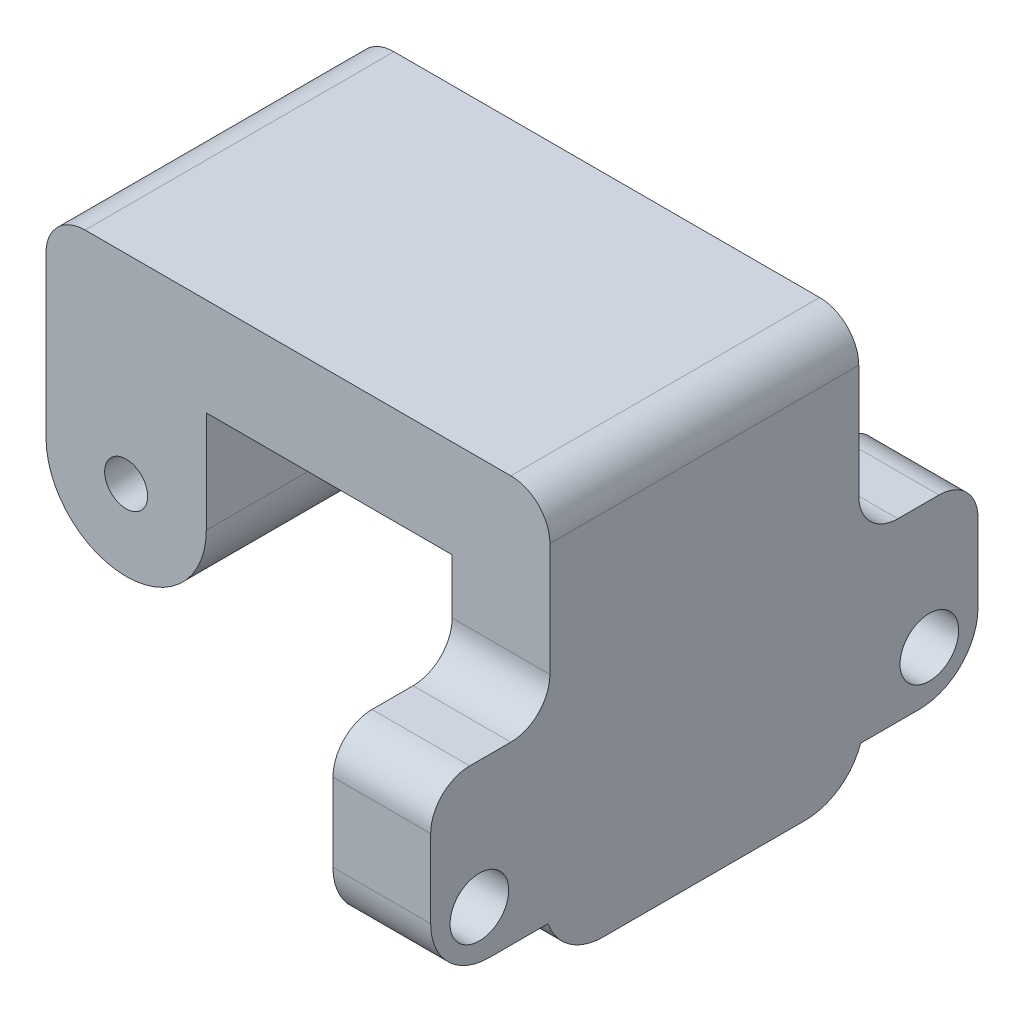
ISO-10303-21;
HEADER;
FILE_DESCRIPTION(('STEP AP214'),'2;1');
FILE_NAME('part.step','',(''),(''),'','','');
FILE_SCHEMA(('AUTOMOTIVE_DESIGN { 1 0 10303 214 1 1 1 1 }'));
ENDSEC;
DATA;
#1=APPLICATION_CONTEXT('core data for automotive mechanical design processes');
#2=APPLICATION_PROTOCOL_DEFINITION('international standard','automotive_design',2000,#1);
#3=PRODUCT_CONTEXT('',#1,'mechanical');
#4=PRODUCT('Part','Part','',(#3));
#5=PRODUCT_RELATED_PRODUCT_CATEGORY('part','',(#4));
#6=PRODUCT_DEFINITION_FORMATION('','',#4);
#7=PRODUCT_DEFINITION_CONTEXT('part definition',#1,'design');
#8=PRODUCT_DEFINITION('design','',#6,#7);
#9=PRODUCT_DEFINITION_SHAPE('','',#8);
#10=(LENGTH_UNIT() NAMED_UNIT(*) SI_UNIT(.MILLI.,.METRE.));
#11=(NAMED_UNIT(*) PLANE_ANGLE_UNIT() SI_UNIT($,.RADIAN.));
#12=(NAMED_UNIT(*) SI_UNIT($,.STERADIAN.) SOLID_ANGLE_UNIT());
#13=UNCERTAINTY_MEASURE_WITH_UNIT(LENGTH_MEASURE(1.E-05),#10,'distance_accuracy_value','');
#14=(GEOMETRIC_REPRESENTATION_CONTEXT(3) GLOBAL_UNCERTAINTY_ASSIGNED_CONTEXT((#13)) GLOBAL_UNIT_ASSIGNED_CONTEXT((#10,
#11,#12)) REPRESENTATION_CONTEXT('',''));
#15=CARTESIAN_POINT('',(0.,0.,0.));
#16=DIRECTION('',(0.,0.,1.));
#17=DIRECTION('',(1.,0.,0.));
#18=AXIS2_PLACEMENT_3D('',#15,#16,#17);
#19=CARTESIAN_POINT('',(21.6802232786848,0.,-7.9));
#20=DIRECTION('',(-1.,0.,0.));
#21=DIRECTION('',(0.,0.,1.));
#22=AXIS2_PLACEMENT_3D('',#19,#20,#21);
#23=PLANE('',#22);
#24=CARTESIAN_POINT('',(21.6802232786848,-6.1,-11.51));
#25=DIRECTION('',(1.,0.,0.));
#26=DIRECTION('',(0.,0.,1.));
#27=AXIS2_PLACEMENT_3D('',#24,#25,#26);
#28=CIRCLE('',#27,1.5);
#29=CARTESIAN_POINT('',(21.6802232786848,-6.1,-10.01));
#30=VERTEX_POINT('',#29);
#31=EDGE_CURVE('E224',#30,#30,#28,.T.);
#32=ORIENTED_EDGE('',*,*,#31,.F.);
#33=EDGE_LOOP('',(#32));
#34=FACE_BOUND('',#33,.T.);
#35=CARTESIAN_POINT('',(21.6802232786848,-6.1,11.51));
#36=DIRECTION('',(1.,0.,0.));
#37=DIRECTION('',(0.,0.,-1.));
#38=AXIS2_PLACEMENT_3D('',#35,#36,#37);
#39=CIRCLE('',#38,1.5);
#40=CARTESIAN_POINT('',(21.6802232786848,-6.1,10.01));
#41=VERTEX_POINT('',#40);
#42=EDGE_CURVE('E235',#41,#41,#39,.T.);
#43=ORIENTED_EDGE('',*,*,#42,.F.);
#44=EDGE_LOOP('',(#43));
#45=FACE_BOUND('',#44,.T.);
#46=DIRECTION('',(0.,0.,1.));
#47=VECTOR('',#46,1.);
#48=CARTESIAN_POINT('',(21.6802232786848,-8.59610842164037,0.));
#49=LINE('',#48,#47);
#50=CARTESIAN_POINT('',(21.6802232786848,-8.59610842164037,-11.));
#51=VERTEX_POINT('',#50);
#52=CARTESIAN_POINT('',(21.6802232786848,-8.59610842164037,-8.));
#53=VERTEX_POINT('',#52);
#54=EDGE_CURVE('E227',#51,#53,#49,.T.);
#55=ORIENTED_EDGE('',*,*,#54,.F.);
#56=CARTESIAN_POINT('',(21.6802232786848,-5.59610842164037,-11.));
#57=DIRECTION('',(-1.,0.,0.));
#58=DIRECTION('',(0.,0.,1.));
#59=AXIS2_PLACEMENT_3D('',#56,#57,#58);
#60=CIRCLE('',#59,3.);
#61=CARTESIAN_POINT('',(21.6802232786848,-5.59610842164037,-14.));
#62=VERTEX_POINT('',#61);
#63=EDGE_CURVE('E393',#51,#62,#60,.F.);
#64=ORIENTED_EDGE('',*,*,#63,.T.);
#65=DIRECTION('',(0.,-1.,0.));
#66=VECTOR('',#65,1.);
#67=CARTESIAN_POINT('',(21.6802232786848,0.,-14.));
#68=LINE('',#67,#66);
#69=CARTESIAN_POINT('',(21.6802232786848,-1.6,-14.));
#70=VERTEX_POINT('',#69);
#71=EDGE_CURVE('E248',#70,#62,#68,.T.);
#72=ORIENTED_EDGE('',*,*,#71,.F.);
#73=CARTESIAN_POINT('',(21.6802232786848,-1.6,-12.));
#74=DIRECTION('',(-1.,0.,0.));
#75=DIRECTION('',(0.,0.,1.));
#76=AXIS2_PLACEMENT_3D('',#73,#74,#75);
#77=CIRCLE('',#76,2.);
#78=CARTESIAN_POINT('',(21.6802232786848,0.4,-12.));
#79=VERTEX_POINT('',#78);
#80=EDGE_CURVE('E341',#70,#79,#77,.F.);
#81=ORIENTED_EDGE('',*,*,#80,.T.);
#82=DIRECTION('',(0.,0.,1.));
#83=VECTOR('',#82,1.);
#84=CARTESIAN_POINT('',(21.6802232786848,0.4,-14.));
#85=LINE('',#84,#83);
#86=CARTESIAN_POINT('',(21.6802232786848,0.4,-9.9));
#87=VERTEX_POINT('',#86);
#88=EDGE_CURVE('E255',#79,#87,#85,.T.);
#89=ORIENTED_EDGE('',*,*,#88,.T.);
#90=CARTESIAN_POINT('',(21.6802232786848,2.4,-9.9));
#91=DIRECTION('',(-1.,0.,0.));
#92=DIRECTION('',(0.,0.,1.));
#93=AXIS2_PLACEMENT_3D('',#90,#91,#92);
#94=CIRCLE('',#93,2.);
#95=CARTESIAN_POINT('',(21.6802232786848,2.4,-7.9));
#96=VERTEX_POINT('',#95);
#97=EDGE_CURVE('E370',#87,#96,#94,.T.);
#98=ORIENTED_EDGE('',*,*,#97,.T.);
#99=DIRECTION('',(0.,-1.,0.));
#100=VECTOR('',#99,1.);
#101=CARTESIAN_POINT('',(21.6802232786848,0.,-7.9));
#102=LINE('',#101,#100);
#103=CARTESIAN_POINT('',(21.6802232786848,8.2,-7.9));
#104=VERTEX_POINT('',#103);
#105=EDGE_CURVE('E295',#104,#96,#102,.T.);
#106=ORIENTED_EDGE('',*,*,#105,.F.);
#107=DIRECTION('',(0.,0.,1.));
#108=VECTOR('',#107,1.);
#109=CARTESIAN_POINT('',(21.6802232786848,8.2,-7.9));
#110=LINE('',#109,#108);
#111=CARTESIAN_POINT('',(21.6802232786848,8.2,7.9));
#112=VERTEX_POINT('',#111);
#113=EDGE_CURVE('E336',#104,#112,#110,.T.);
#114=ORIENTED_EDGE('',*,*,#113,.T.);
#115=DIRECTION('',(0.,-1.,0.));
#116=VECTOR('',#115,1.);
#117=CARTESIAN_POINT('',(21.6802232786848,0.,7.9));
#118=LINE('',#117,#116);
#119=CARTESIAN_POINT('',(21.6802232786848,2.4,7.9));
#120=VERTEX_POINT('',#119);
#121=EDGE_CURVE('E273',#112,#120,#118,.T.);
#122=ORIENTED_EDGE('',*,*,#121,.T.);
#123=CARTESIAN_POINT('',(21.6802232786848,2.4,9.9));
#124=DIRECTION('',(-1.,0.,0.));
#125=DIRECTION('',(0.,0.,1.));
#126=AXIS2_PLACEMENT_3D('',#123,#124,#125);
#127=CIRCLE('',#126,2.);
#128=CARTESIAN_POINT('',(21.6802232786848,0.4,9.9));
#129=VERTEX_POINT('',#128);
#130=EDGE_CURVE('E374',#120,#129,#127,.T.);
#131=ORIENTED_EDGE('',*,*,#130,.T.);
#132=CARTESIAN_POINT('',(21.6802232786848,0.4,12.));
#133=VERTEX_POINT('',#132);
#134=EDGE_CURVE('E252',#129,#133,#85,.T.);
#135=ORIENTED_EDGE('',*,*,#134,.T.);
#136=CARTESIAN_POINT('',(21.6802232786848,-1.6,12.));
#137=DIRECTION('',(-1.,0.,0.));
#138=DIRECTION('',(0.,0.,1.));
#139=AXIS2_PLACEMENT_3D('',#136,#137,#138);
#140=CIRCLE('',#139,2.);
#141=CARTESIAN_POINT('',(21.6802232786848,-1.6,14.));
#142=VERTEX_POINT('',#141);
#143=EDGE_CURVE('E339',#133,#142,#140,.F.);
#144=ORIENTED_EDGE('',*,*,#143,.T.);
#145=DIRECTION('',(0.,-1.,0.));
#146=VECTOR('',#145,1.);
#147=CARTESIAN_POINT('',(21.6802232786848,0.,14.));
#148=LINE('',#147,#146);
#149=CARTESIAN_POINT('',(21.6802232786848,-5.59610842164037,14.));
#150=VERTEX_POINT('',#149);
#151=EDGE_CURVE('E243',#142,#150,#148,.T.);
#152=ORIENTED_EDGE('',*,*,#151,.T.);
#153=CARTESIAN_POINT('',(21.6802232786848,-5.59610842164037,11.));
#154=DIRECTION('',(-1.,0.,0.));
#155=DIRECTION('',(0.,0.,1.));
#156=AXIS2_PLACEMENT_3D('',#153,#154,#155);
#157=CIRCLE('',#156,3.);
#158=CARTESIAN_POINT('',(21.6802232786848,-8.59610842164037,11.));
#159=VERTEX_POINT('',#158);
#160=EDGE_CURVE('E58',#150,#159,#157,.F.);
#161=ORIENTED_EDGE('',*,*,#160,.T.);
#162=DIRECTION('',(0.,0.,-1.));
#163=VECTOR('',#162,1.);
#164=CARTESIAN_POINT('',(21.6802232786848,-8.59610842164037,0.));
#165=LINE('',#164,#163);
#166=CARTESIAN_POINT('',(21.6802232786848,-8.59610842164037,8.));
#167=VERTEX_POINT('',#166);
#168=EDGE_CURVE('E213',#159,#167,#165,.T.);
#169=ORIENTED_EDGE('',*,*,#168,.T.);
#170=CARTESIAN_POINT('',(21.6802232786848,-7.59610842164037,5.17157287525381));
#171=DIRECTION('',(-1.,0.,0.));
#172=DIRECTION('',(0.,0.,1.));
#173=AXIS2_PLACEMENT_3D('',#170,#171,#172);
#174=CIRCLE('',#173,3.);
#175=CARTESIAN_POINT('',(21.6802232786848,-10.5961084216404,5.17157287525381));
#176=VERTEX_POINT('',#175);
#177=EDGE_CURVE('E66',#167,#176,#174,.F.);
#178=ORIENTED_EDGE('',*,*,#177,.T.);
#179=DIRECTION('',(0.,0.,1.));
#180=VECTOR('',#179,1.);
#181=CARTESIAN_POINT('',(21.6802232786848,-10.5961084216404,-7.9));
#182=LINE('',#181,#180);
#183=CARTESIAN_POINT('',(21.6802232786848,-10.5961084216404,-5.17157287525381));
#184=VERTEX_POINT('',#183);
#185=EDGE_CURVE('E308',#184,#176,#182,.T.);
#186=ORIENTED_EDGE('',*,*,#185,.F.);
#187=CARTESIAN_POINT('',(21.6802232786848,-7.59610842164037,-5.17157287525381));
#188=DIRECTION('',(-1.,0.,0.));
#189=DIRECTION('',(0.,0.,1.));
#190=AXIS2_PLACEMENT_3D('',#187,#188,#189);
#191=CIRCLE('',#190,3.);
#192=EDGE_CURVE('E210',#184,#53,#191,.F.);
#193=ORIENTED_EDGE('',*,*,#192,.T.);
#194=EDGE_LOOP('',(#55,#64,#72,#81,#89,#98,#106,#114,#122,#131,#135,#144,#152,#161,#169,#178,
#186,#193));
#195=FACE_BOUND('',#194,.T.);
#196=ADVANCED_FACE('F43',(#34,#45,#195),#23,.F.);
#197=CARTESIAN_POINT('',(0.,-10.5961084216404,-7.9));
#198=DIRECTION('',(0.,1.,0.));
#199=DIRECTION('',(-1.,0.,0.));
#200=AXIS2_PLACEMENT_3D('',#197,#198,#199);
#201=PLANE('',#200);
#202=DIRECTION('',(0.,0.,1.));
#203=VECTOR('',#202,1.);
#204=CARTESIAN_POINT('',(16.6802232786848,-10.5961084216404,-7.9));
#205=LINE('',#204,#203);
#206=CARTESIAN_POINT('',(16.6802232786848,-10.5961084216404,-5.17157287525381));
#207=VERTEX_POINT('',#206);
#208=CARTESIAN_POINT('',(16.6802232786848,-10.5961084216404,5.17157287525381));
#209=VERTEX_POINT('',#208);
#210=EDGE_CURVE('E310',#207,#209,#205,.T.);
#211=ORIENTED_EDGE('',*,*,#210,.F.);
#212=DIRECTION('',(-1.,0.,0.));
#213=VECTOR('',#212,1.);
#214=CARTESIAN_POINT('',(0.,-10.5961084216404,-5.17157287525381));
#215=LINE('',#214,#213);
#216=EDGE_CURVE('E396',#207,#184,#215,.F.);
#217=ORIENTED_EDGE('',*,*,#216,.T.);
#218=ORIENTED_EDGE('',*,*,#185,.T.);
#219=DIRECTION('',(1.,0.,0.));
#220=VECTOR('',#219,1.);
#221=CARTESIAN_POINT('',(0.,-10.5961084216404,5.17157287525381));
#222=LINE('',#221,#220);
#223=EDGE_CURVE('E209',#176,#209,#222,.F.);
#224=ORIENTED_EDGE('',*,*,#223,.T.);
#225=EDGE_LOOP('',(#211,#217,#218,#224));
#226=FACE_BOUND('',#225,.T.);
#227=ADVANCED_FACE('F492',(#226),#201,.F.);
#228=CARTESIAN_POINT('',(16.6802232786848,0.,-7.9));
#229=DIRECTION('',(1.,0.,0.));
#230=DIRECTION('',(0.,0.,-1.));
#231=AXIS2_PLACEMENT_3D('',#228,#229,#230);
#232=PLANE('',#231);
#233=CARTESIAN_POINT('',(16.6802232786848,-6.1,-11.51));
#234=DIRECTION('',(1.,0.,0.));
#235=DIRECTION('',(0.,0.,-1.));
#236=AXIS2_PLACEMENT_3D('',#233,#234,#235);
#237=CIRCLE('',#236,1.5);
#238=CARTESIAN_POINT('',(16.6802232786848,-6.1,-13.01));
#239=VERTEX_POINT('',#238);
#240=EDGE_CURVE('E238',#239,#239,#237,.T.);
#241=ORIENTED_EDGE('',*,*,#240,.T.);
#242=EDGE_LOOP('',(#241));
#243=FACE_BOUND('',#242,.T.);
#244=CARTESIAN_POINT('',(16.6802232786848,-6.1,11.51));
#245=DIRECTION('',(1.,0.,0.));
#246=DIRECTION('',(0.,0.,-1.));
#247=AXIS2_PLACEMENT_3D('',#244,#245,#246);
#248=CIRCLE('',#247,1.5);
#249=CARTESIAN_POINT('',(16.6802232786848,-6.1,10.01));
#250=VERTEX_POINT('',#249);
#251=EDGE_CURVE('E244',#250,#250,#248,.T.);
#252=ORIENTED_EDGE('',*,*,#251,.T.);
#253=EDGE_LOOP('',(#252));
#254=FACE_BOUND('',#253,.T.);
#255=DIRECTION('',(0.,1.,0.));
#256=VECTOR('',#255,1.);
#257=CARTESIAN_POINT('',(16.6802232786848,0.,-14.));
#258=LINE('',#257,#256);
#259=CARTESIAN_POINT('',(16.6802232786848,-5.59610842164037,-14.));
#260=VERTEX_POINT('',#259);
#261=CARTESIAN_POINT('',(16.6802232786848,-1.6,-14.));
#262=VERTEX_POINT('',#261);
#263=EDGE_CURVE('E246',#260,#262,#258,.T.);
#264=ORIENTED_EDGE('',*,*,#263,.F.);
#265=CARTESIAN_POINT('',(16.6802232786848,-5.59610842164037,-11.));
#266=DIRECTION('',(1.,0.,0.));
#267=DIRECTION('',(0.,0.,-1.));
#268=AXIS2_PLACEMENT_3D('',#265,#266,#267);
#269=CIRCLE('',#268,3.);
#270=CARTESIAN_POINT('',(16.6802232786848,-8.59610842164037,-11.));
#271=VERTEX_POINT('',#270);
#272=EDGE_CURVE('E387',#260,#271,#269,.F.);
#273=ORIENTED_EDGE('',*,*,#272,.T.);
#274=DIRECTION('',(0.,0.,-1.));
#275=VECTOR('',#274,1.);
#276=CARTESIAN_POINT('',(16.6802232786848,-8.59610842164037,0.));
#277=LINE('',#276,#275);
#278=CARTESIAN_POINT('',(16.6802232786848,-8.59610842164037,-8.));
#279=VERTEX_POINT('',#278);
#280=EDGE_CURVE('E217',#279,#271,#277,.T.);
#281=ORIENTED_EDGE('',*,*,#280,.F.);
#282=CARTESIAN_POINT('',(16.6802232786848,-7.59610842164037,-5.17157287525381));
#283=DIRECTION('',(1.,0.,0.));
#284=DIRECTION('',(0.,0.,-1.));
#285=AXIS2_PLACEMENT_3D('',#282,#283,#284);
#286=CIRCLE('',#285,3.);
#287=EDGE_CURVE('E385',#279,#207,#286,.F.);
#288=ORIENTED_EDGE('',*,*,#287,.T.);
#289=ORIENTED_EDGE('',*,*,#210,.T.);
#290=CARTESIAN_POINT('',(16.6802232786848,-7.59610842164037,5.17157287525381));
#291=DIRECTION('',(1.,0.,0.));
#292=DIRECTION('',(0.,0.,-1.));
#293=AXIS2_PLACEMENT_3D('',#290,#291,#292);
#294=CIRCLE('',#293,3.);
#295=CARTESIAN_POINT('',(16.6802232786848,-8.59610842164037,8.));
#296=VERTEX_POINT('',#295);
#297=EDGE_CURVE('E383',#209,#296,#294,.F.);
#298=ORIENTED_EDGE('',*,*,#297,.T.);
#299=DIRECTION('',(0.,0.,1.));
#300=VECTOR('',#299,1.);
#301=CARTESIAN_POINT('',(16.6802232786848,-8.59610842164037,0.));
#302=LINE('',#301,#300);
#303=CARTESIAN_POINT('',(16.6802232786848,-8.59610842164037,11.));
#304=VERTEX_POINT('',#303);
#305=EDGE_CURVE('E222',#296,#304,#302,.T.);
#306=ORIENTED_EDGE('',*,*,#305,.T.);
#307=CARTESIAN_POINT('',(16.6802232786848,-5.59610842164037,11.));
#308=DIRECTION('',(1.,0.,0.));
#309=DIRECTION('',(0.,0.,-1.));
#310=AXIS2_PLACEMENT_3D('',#307,#308,#309);
#311=CIRCLE('',#310,3.);
#312=CARTESIAN_POINT('',(16.6802232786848,-5.59610842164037,14.));
#313=VERTEX_POINT('',#312);
#314=EDGE_CURVE('E381',#304,#313,#311,.F.);
#315=ORIENTED_EDGE('',*,*,#314,.T.);
#316=DIRECTION('',(0.,1.,0.));
#317=VECTOR('',#316,1.);
#318=CARTESIAN_POINT('',(16.6802232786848,0.,14.));
#319=LINE('',#318,#317);
#320=CARTESIAN_POINT('',(16.6802232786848,-1.6,14.));
#321=VERTEX_POINT('',#320);
#322=EDGE_CURVE('E241',#313,#321,#319,.T.);
#323=ORIENTED_EDGE('',*,*,#322,.T.);
#324=CARTESIAN_POINT('',(16.6802232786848,-1.6,12.));
#325=DIRECTION('',(1.,0.,0.));
#326=DIRECTION('',(0.,0.,-1.));
#327=AXIS2_PLACEMENT_3D('',#324,#325,#326);
#328=CIRCLE('',#327,2.);
#329=CARTESIAN_POINT('',(16.6802232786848,0.4,12.));
#330=VERTEX_POINT('',#329);
#331=EDGE_CURVE('E343',#321,#330,#328,.F.);
#332=ORIENTED_EDGE('',*,*,#331,.T.);
#333=DIRECTION('',(0.,0.,1.));
#334=VECTOR('',#333,1.);
#335=CARTESIAN_POINT('',(16.6802232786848,0.4,-14.));
#336=LINE('',#335,#334);
#337=CARTESIAN_POINT('',(16.6802232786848,0.4,9.9));
#338=VERTEX_POINT('',#337);
#339=EDGE_CURVE('E251',#338,#330,#336,.T.);
#340=ORIENTED_EDGE('',*,*,#339,.F.);
#341=CARTESIAN_POINT('',(16.6802232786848,2.4,9.9));
#342=DIRECTION('',(1.,0.,0.));
#343=DIRECTION('',(0.,0.,-1.));
#344=AXIS2_PLACEMENT_3D('',#341,#342,#343);
#345=CIRCLE('',#344,2.);
#346=CARTESIAN_POINT('',(16.6802232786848,2.4,7.9));
#347=VERTEX_POINT('',#346);
#348=EDGE_CURVE('E376',#338,#347,#345,.T.);
#349=ORIENTED_EDGE('',*,*,#348,.T.);
#350=DIRECTION('',(0.,1.,0.));
#351=VECTOR('',#350,1.);
#352=CARTESIAN_POINT('',(16.6802232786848,0.,7.9));
#353=LINE('',#352,#351);
#354=CARTESIAN_POINT('',(16.6802232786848,5.2,7.9));
#355=VERTEX_POINT('',#354);
#356=EDGE_CURVE('E271',#347,#355,#353,.T.);
#357=ORIENTED_EDGE('',*,*,#356,.T.);
#358=DIRECTION('',(0.,0.,1.));
#359=VECTOR('',#358,1.);
#360=CARTESIAN_POINT('',(16.6802232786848,5.2,-7.9));
#361=LINE('',#360,#359);
#362=CARTESIAN_POINT('',(16.6802232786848,5.2,-7.9));
#363=VERTEX_POINT('',#362);
#364=EDGE_CURVE('E313',#363,#355,#361,.T.);
#365=ORIENTED_EDGE('',*,*,#364,.F.);
#366=DIRECTION('',(0.,1.,0.));
#367=VECTOR('',#366,1.);
#368=CARTESIAN_POINT('',(16.6802232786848,0.,-7.9));
#369=LINE('',#368,#367);
#370=CARTESIAN_POINT('',(16.6802232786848,2.4,-7.9));
#371=VERTEX_POINT('',#370);
#372=EDGE_CURVE('E293',#371,#363,#369,.T.);
#373=ORIENTED_EDGE('',*,*,#372,.F.);
#374=CARTESIAN_POINT('',(16.6802232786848,2.4,-9.9));
#375=DIRECTION('',(1.,0.,0.));
#376=DIRECTION('',(0.,0.,-1.));
#377=AXIS2_PLACEMENT_3D('',#374,#375,#376);
#378=CIRCLE('',#377,2.);
#379=CARTESIAN_POINT('',(16.6802232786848,0.4,-9.9));
#380=VERTEX_POINT('',#379);
#381=EDGE_CURVE('E372',#371,#380,#378,.T.);
#382=ORIENTED_EDGE('',*,*,#381,.T.);
#383=CARTESIAN_POINT('',(16.6802232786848,0.4,-12.));
#384=VERTEX_POINT('',#383);
#385=EDGE_CURVE('E256',#384,#380,#336,.T.);
#386=ORIENTED_EDGE('',*,*,#385,.F.);
#387=CARTESIAN_POINT('',(16.6802232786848,-1.6,-12.));
#388=DIRECTION('',(1.,0.,0.));
#389=DIRECTION('',(0.,0.,-1.));
#390=AXIS2_PLACEMENT_3D('',#387,#388,#389);
#391=CIRCLE('',#390,2.);
#392=EDGE_CURVE('E345',#384,#262,#391,.F.);
#393=ORIENTED_EDGE('',*,*,#392,.T.);
#394=EDGE_LOOP('',(#264,#273,#281,#288,#289,#298,#306,#315,#323,#332,#340,#349,#357,#365,#373,
#382,#386,#393));
#395=FACE_BOUND('',#394,.T.);
#396=ADVANCED_FACE('F416',(#243,#254,#395),#232,.F.);
#397=CARTESIAN_POINT('',(0.,0.,-7.9));
#398=DIRECTION('',(0.,0.,1.));
#399=DIRECTION('',(1.,0.,0.));
#400=AXIS2_PLACEMENT_3D('',#397,#398,#399);
#401=PLANE('',#400);
#402=CARTESIAN_POINT('',(0.,0.,-7.9));
#403=DIRECTION('',(0.,0.,1.));
#404=DIRECTION('',(1.,0.,0.));
#405=AXIS2_PLACEMENT_3D('',#402,#403,#404);
#406=CIRCLE('',#405,1.10000000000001);
#407=CARTESIAN_POINT('',(1.10000000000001,0.,-7.9));
#408=VERTEX_POINT('',#407);
#409=EDGE_CURVE('E282',#408,#408,#406,.T.);
#410=ORIENTED_EDGE('',*,*,#409,.T.);
#411=EDGE_LOOP('',(#410));
#412=FACE_BOUND('',#411,.T.);
#413=ORIENTED_EDGE('',*,*,#105,.T.);
#414=DIRECTION('',(1.,0.,0.));
#415=VECTOR('',#414,1.);
#416=CARTESIAN_POINT('',(16.6802232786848,2.4,-7.9));
#417=LINE('',#416,#415);
#418=EDGE_CURVE('E331',#96,#371,#417,.F.);
#419=ORIENTED_EDGE('',*,*,#418,.T.);
#420=ORIENTED_EDGE('',*,*,#372,.T.);
#421=DIRECTION('',(-1.,0.,0.));
#422=VECTOR('',#421,1.);
#423=CARTESIAN_POINT('',(0.,5.2,-7.9));
#424=LINE('',#423,#422);
#425=CARTESIAN_POINT('',(4.10000000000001,5.2,-7.9));
#426=VERTEX_POINT('',#425);
#427=EDGE_CURVE('E290',#363,#426,#424,.T.);
#428=ORIENTED_EDGE('',*,*,#427,.T.);
#429=DIRECTION('',(0.,-1.,0.));
#430=VECTOR('',#429,1.);
#431=CARTESIAN_POINT('',(4.10000000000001,0.,-7.9));
#432=LINE('',#431,#430);
#433=CARTESIAN_POINT('',(4.10000000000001,0.,-7.9));
#434=VERTEX_POINT('',#433);
#435=EDGE_CURVE('E288',#426,#434,#432,.T.);
#436=ORIENTED_EDGE('',*,*,#435,.T.);
#437=CARTESIAN_POINT('',(0.,0.,-7.9));
#438=DIRECTION('',(0.,0.,1.));
#439=DIRECTION('',(1.,0.,0.));
#440=AXIS2_PLACEMENT_3D('',#437,#438,#439);
#441=CIRCLE('',#440,4.10000000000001);
#442=CARTESIAN_POINT('',(-4.10000000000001,0.,-7.9));
#443=VERTEX_POINT('',#442);
#444=EDGE_CURVE('E285',#443,#434,#441,.T.);
#445=ORIENTED_EDGE('',*,*,#444,.F.);
#446=DIRECTION('',(0.,1.,0.));
#447=VECTOR('',#446,1.);
#448=CARTESIAN_POINT('',(-4.10000000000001,0.,-7.9));
#449=LINE('',#448,#447);
#450=CARTESIAN_POINT('',(-4.10000000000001,8.2,-7.9));
#451=VERTEX_POINT('',#450);
#452=EDGE_CURVE('E301',#443,#451,#449,.T.);
#453=ORIENTED_EDGE('',*,*,#452,.T.);
#454=CARTESIAN_POINT('',(-2.10000000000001,8.2,-7.9));
#455=DIRECTION('',(0.,0.,1.));
#456=DIRECTION('',(1.,0.,0.));
#457=AXIS2_PLACEMENT_3D('',#454,#455,#456);
#458=CIRCLE('',#457,2.);
#459=CARTESIAN_POINT('',(-2.10000000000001,10.2,-7.9));
#460=VERTEX_POINT('',#459);
#461=EDGE_CURVE('E327',#451,#460,#458,.F.);
#462=ORIENTED_EDGE('',*,*,#461,.T.);
#463=DIRECTION('',(1.,0.,0.));
#464=VECTOR('',#463,1.);
#465=CARTESIAN_POINT('',(0.,10.2,-7.9));
#466=LINE('',#465,#464);
#467=CARTESIAN_POINT('',(19.6802232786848,10.2,-7.9));
#468=VERTEX_POINT('',#467);
#469=EDGE_CURVE('E298',#460,#468,#466,.T.);
#470=ORIENTED_EDGE('',*,*,#469,.T.);
#471=CARTESIAN_POINT('',(19.6802232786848,8.2,-7.9));
#472=DIRECTION('',(0.,0.,1.));
#473=DIRECTION('',(1.,0.,0.));
#474=AXIS2_PLACEMENT_3D('',#471,#472,#473);
#475=CIRCLE('',#474,2.);
#476=EDGE_CURVE('E329',#468,#104,#475,.F.);
#477=ORIENTED_EDGE('',*,*,#476,.T.);
#478=EDGE_LOOP('',(#413,#419,#420,#428,#436,#445,#453,#462,#470,#477));
#479=FACE_BOUND('',#478,.T.);
#480=ADVANCED_FACE('F499',(#412,#479),#401,.F.);
#481=CARTESIAN_POINT('',(0.,0.,7.9));
#482=DIRECTION('',(0.,0.,1.));
#483=DIRECTION('',(1.,0.,0.));
#484=AXIS2_PLACEMENT_3D('',#481,#482,#483);
#485=PLANE('',#484);
#486=CARTESIAN_POINT('',(0.,0.,7.9));
#487=DIRECTION('',(0.,0.,1.));
#488=DIRECTION('',(1.,0.,0.));
#489=AXIS2_PLACEMENT_3D('',#486,#487,#488);
#490=CIRCLE('',#489,1.10000000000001);
#491=CARTESIAN_POINT('',(1.10000000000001,0.,7.9));
#492=VERTEX_POINT('',#491);
#493=EDGE_CURVE('E259',#492,#492,#490,.T.);
#494=ORIENTED_EDGE('',*,*,#493,.F.);
#495=EDGE_LOOP('',(#494));
#496=FACE_BOUND('',#495,.T.);
#497=ORIENTED_EDGE('',*,*,#356,.F.);
#498=DIRECTION('',(1.,0.,0.));
#499=VECTOR('',#498,1.);
#500=CARTESIAN_POINT('',(0.,2.4,7.9));
#501=LINE('',#500,#499);
#502=EDGE_CURVE('E360',#347,#120,#501,.T.);
#503=ORIENTED_EDGE('',*,*,#502,.T.);
#504=ORIENTED_EDGE('',*,*,#121,.F.);
#505=CARTESIAN_POINT('',(19.6802232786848,8.2,7.9));
#506=DIRECTION('',(0.,0.,1.));
#507=DIRECTION('',(1.,0.,0.));
#508=AXIS2_PLACEMENT_3D('',#505,#506,#507);
#509=CIRCLE('',#508,2.);
#510=CARTESIAN_POINT('',(19.6802232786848,10.2,7.9));
#511=VERTEX_POINT('',#510);
#512=EDGE_CURVE('E358',#112,#511,#509,.T.);
#513=ORIENTED_EDGE('',*,*,#512,.T.);
#514=DIRECTION('',(1.,0.,0.));
#515=VECTOR('',#514,1.);
#516=CARTESIAN_POINT('',(0.,10.2,7.9));
#517=LINE('',#516,#515);
#518=CARTESIAN_POINT('',(-2.10000000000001,10.2,7.9));
#519=VERTEX_POINT('',#518);
#520=EDGE_CURVE('E276',#519,#511,#517,.T.);
#521=ORIENTED_EDGE('',*,*,#520,.F.);
#522=CARTESIAN_POINT('',(-2.10000000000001,8.2,7.9));
#523=DIRECTION('',(0.,0.,1.));
#524=DIRECTION('',(1.,0.,0.));
#525=AXIS2_PLACEMENT_3D('',#522,#523,#524);
#526=CIRCLE('',#525,2.);
#527=CARTESIAN_POINT('',(-4.10000000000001,8.2,7.9));
#528=VERTEX_POINT('',#527);
#529=EDGE_CURVE('E356',#519,#528,#526,.T.);
#530=ORIENTED_EDGE('',*,*,#529,.T.);
#531=DIRECTION('',(0.,1.,0.));
#532=VECTOR('',#531,1.);
#533=CARTESIAN_POINT('',(-4.10000000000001,0.,7.9));
#534=LINE('',#533,#532);
#535=CARTESIAN_POINT('',(-4.10000000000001,0.,7.9));
#536=VERTEX_POINT('',#535);
#537=EDGE_CURVE('E279',#536,#528,#534,.T.);
#538=ORIENTED_EDGE('',*,*,#537,.F.);
#539=CARTESIAN_POINT('',(0.,0.,7.9));
#540=DIRECTION('',(0.,0.,1.));
#541=DIRECTION('',(1.,0.,0.));
#542=AXIS2_PLACEMENT_3D('',#539,#540,#541);
#543=CIRCLE('',#542,4.10000000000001);
#544=CARTESIAN_POINT('',(4.10000000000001,0.,7.9));
#545=VERTEX_POINT('',#544);
#546=EDGE_CURVE('E262',#536,#545,#543,.T.);
#547=ORIENTED_EDGE('',*,*,#546,.T.);
#548=DIRECTION('',(0.,-1.,0.));
#549=VECTOR('',#548,1.);
#550=CARTESIAN_POINT('',(4.10000000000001,0.,7.9));
#551=LINE('',#550,#549);
#552=CARTESIAN_POINT('',(4.10000000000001,5.2,7.9));
#553=VERTEX_POINT('',#552);
#554=EDGE_CURVE('E265',#553,#545,#551,.T.);
#555=ORIENTED_EDGE('',*,*,#554,.F.);
#556=DIRECTION('',(-1.,0.,0.));
#557=VECTOR('',#556,1.);
#558=CARTESIAN_POINT('',(0.,5.2,7.9));
#559=LINE('',#558,#557);
#560=EDGE_CURVE('E268',#355,#553,#559,.T.);
#561=ORIENTED_EDGE('',*,*,#560,.F.);
#562=EDGE_LOOP('',(#497,#503,#504,#513,#521,#530,#538,#547,#555,#561));
#563=FACE_BOUND('',#562,.T.);
#564=ADVANCED_FACE('F423',(#496,#563),#485,.T.);
#565=CARTESIAN_POINT('',(0.,0.,-7.9));
#566=DIRECTION('',(0.,0.,1.));
#567=DIRECTION('',(1.,0.,0.));
#568=AXIS2_PLACEMENT_3D('',#565,#566,#567);
#569=CYLINDRICAL_SURFACE('',#568,4.10000000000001);
#570=DIRECTION('',(0.,0.,1.));
#571=VECTOR('',#570,1.);
#572=CARTESIAN_POINT('',(4.10000000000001,0.,-7.9));
#573=LINE('',#572,#571);
#574=EDGE_CURVE('E304',#434,#545,#573,.T.);
#575=ORIENTED_EDGE('',*,*,#574,.T.);
#576=ORIENTED_EDGE('',*,*,#546,.F.);
#577=DIRECTION('',(0.,0.,1.));
#578=VECTOR('',#577,1.);
#579=CARTESIAN_POINT('',(-4.10000000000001,0.,-7.9));
#580=LINE('',#579,#578);
#581=EDGE_CURVE('E305',#443,#536,#580,.T.);
#582=ORIENTED_EDGE('',*,*,#581,.F.);
#583=ORIENTED_EDGE('',*,*,#444,.T.);
#584=EDGE_LOOP('',(#575,#576,#582,#583));
#585=FACE_BOUND('',#584,.T.);
#586=ADVANCED_FACE('F447',(#585),#569,.T.);
#587=CARTESIAN_POINT('',(-4.10000000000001,0.,-7.9));
#588=DIRECTION('',(1.,0.,0.));
#589=DIRECTION('',(0.,0.,-1.));
#590=AXIS2_PLACEMENT_3D('',#587,#588,#589);
#591=PLANE('',#590);
#592=ORIENTED_EDGE('',*,*,#537,.T.);
#593=DIRECTION('',(0.,0.,1.));
#594=VECTOR('',#593,1.);
#595=CARTESIAN_POINT('',(-4.10000000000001,8.2,-7.9));
#596=LINE('',#595,#594);
#597=EDGE_CURVE('E368',#528,#451,#596,.F.);
#598=ORIENTED_EDGE('',*,*,#597,.T.);
#599=ORIENTED_EDGE('',*,*,#452,.F.);
#600=ORIENTED_EDGE('',*,*,#581,.T.);
#601=EDGE_LOOP('',(#592,#598,#599,#600));
#602=FACE_BOUND('',#601,.T.);
#603=ADVANCED_FACE('F442',(#602),#591,.F.);
#604=CARTESIAN_POINT('',(0.,10.2,-7.9));
#605=DIRECTION('',(0.,-1.,0.));
#606=DIRECTION('',(0.,0.,-1.));
#607=AXIS2_PLACEMENT_3D('',#604,#605,#606);
#608=PLANE('',#607);
#609=ORIENTED_EDGE('',*,*,#520,.T.);
#610=DIRECTION('',(0.,0.,1.));
#611=VECTOR('',#610,1.);
#612=CARTESIAN_POINT('',(19.6802232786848,10.2,-7.9));
#613=LINE('',#612,#611);
#614=EDGE_CURVE('E366',#511,#468,#613,.F.);
#615=ORIENTED_EDGE('',*,*,#614,.T.);
#616=ORIENTED_EDGE('',*,*,#469,.F.);
#617=DIRECTION('',(0.,0.,1.));
#618=VECTOR('',#617,1.);
#619=CARTESIAN_POINT('',(-2.10000000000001,10.2,-7.9));
#620=LINE('',#619,#618);
#621=EDGE_CURVE('E363',#460,#519,#620,.T.);
#622=ORIENTED_EDGE('',*,*,#621,.T.);
#623=EDGE_LOOP('',(#609,#615,#616,#622));
#624=FACE_BOUND('',#623,.T.);
#625=ADVANCED_FACE('F433',(#624),#608,.F.);
#626=CARTESIAN_POINT('',(0.,5.2,-7.9));
#627=DIRECTION('',(0.,1.,0.));
#628=DIRECTION('',(-1.,0.,0.));
#629=AXIS2_PLACEMENT_3D('',#626,#627,#628);
#630=PLANE('',#629);
#631=ORIENTED_EDGE('',*,*,#364,.T.);
#632=ORIENTED_EDGE('',*,*,#560,.T.);
#633=DIRECTION('',(0.,0.,1.));
#634=VECTOR('',#633,1.);
#635=CARTESIAN_POINT('',(4.10000000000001,5.2,-7.9));
#636=LINE('',#635,#634);
#637=EDGE_CURVE('E316',#426,#553,#636,.T.);
#638=ORIENTED_EDGE('',*,*,#637,.F.);
#639=ORIENTED_EDGE('',*,*,#427,.F.);
#640=EDGE_LOOP('',(#631,#632,#638,#639));
#641=FACE_BOUND('',#640,.T.);
#642=ADVANCED_FACE('F455',(#641),#630,.F.);
#643=CARTESIAN_POINT('',(0.,0.,-7.9));
#644=DIRECTION('',(0.,0.,1.));
#645=DIRECTION('',(1.,0.,0.));
#646=AXIS2_PLACEMENT_3D('',#643,#644,#645);
#647=CYLINDRICAL_SURFACE('',#646,1.10000000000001);
#648=ORIENTED_EDGE('',*,*,#409,.F.);
#649=EDGE_LOOP('',(#648));
#650=FACE_BOUND('',#649,.T.);
#651=ORIENTED_EDGE('',*,*,#493,.T.);
#652=EDGE_LOOP('',(#651));
#653=FACE_BOUND('',#652,.T.);
#654=ADVANCED_FACE('F508',(#650,#653),#647,.F.);
#655=CARTESIAN_POINT('',(4.10000000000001,0.,-7.9));
#656=DIRECTION('',(-1.,0.,0.));
#657=DIRECTION('',(0.,0.,1.));
#658=AXIS2_PLACEMENT_3D('',#655,#656,#657);
#659=PLANE('',#658);
#660=ORIENTED_EDGE('',*,*,#637,.T.);
#661=ORIENTED_EDGE('',*,*,#554,.T.);
#662=ORIENTED_EDGE('',*,*,#574,.F.);
#663=ORIENTED_EDGE('',*,*,#435,.F.);
#664=EDGE_LOOP('',(#660,#661,#662,#663));
#665=FACE_BOUND('',#664,.T.);
#666=ADVANCED_FACE('F451',(#665),#659,.F.);
#667=CARTESIAN_POINT('',(0.,0.,14.));
#668=DIRECTION('',(0.,0.,1.));
#669=DIRECTION('',(1.,0.,0.));
#670=AXIS2_PLACEMENT_3D('',#667,#668,#669);
#671=PLANE('',#670);
#672=ORIENTED_EDGE('',*,*,#322,.F.);
#673=DIRECTION('',(1.,0.,0.));
#674=VECTOR('',#673,1.);
#675=CARTESIAN_POINT('',(0.,-5.59610842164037,14.));
#676=LINE('',#675,#674);
#677=EDGE_CURVE('E51',#313,#150,#676,.T.);
#678=ORIENTED_EDGE('',*,*,#677,.T.);
#679=ORIENTED_EDGE('',*,*,#151,.F.);
#680=DIRECTION('',(1.,0.,0.));
#681=VECTOR('',#680,1.);
#682=CARTESIAN_POINT('',(16.6802232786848,-1.6,14.));
#683=LINE('',#682,#681);
#684=EDGE_CURVE('E348',#142,#321,#683,.F.);
#685=ORIENTED_EDGE('',*,*,#684,.T.);
#686=EDGE_LOOP('',(#672,#678,#679,#685));
#687=FACE_BOUND('',#686,.T.);
#688=ADVANCED_FACE('F401',(#687),#671,.T.);
#689=CARTESIAN_POINT('',(0.,0.4,-14.));
#690=DIRECTION('',(0.,-1.,0.));
#691=DIRECTION('',(0.,0.,-1.));
#692=AXIS2_PLACEMENT_3D('',#689,#690,#691);
#693=PLANE('',#692);
#694=ORIENTED_EDGE('',*,*,#339,.T.);
#695=DIRECTION('',(1.,0.,0.));
#696=VECTOR('',#695,1.);
#697=CARTESIAN_POINT('',(21.6802232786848,0.4,12.));
#698=LINE('',#697,#696);
#699=EDGE_CURVE('E353',#330,#133,#698,.T.);
#700=ORIENTED_EDGE('',*,*,#699,.T.);
#701=ORIENTED_EDGE('',*,*,#134,.F.);
#702=DIRECTION('',(1.,0.,0.));
#703=VECTOR('',#702,1.);
#704=CARTESIAN_POINT('',(0.,0.4,9.9));
#705=LINE('',#704,#703);
#706=EDGE_CURVE('E351',#129,#338,#705,.F.);
#707=ORIENTED_EDGE('',*,*,#706,.T.);
#708=EDGE_LOOP('',(#694,#700,#701,#707));
#709=FACE_BOUND('',#708,.T.);
#710=ADVANCED_FACE('F410',(#709),#693,.F.);
#711=ORIENTED_EDGE('',*,*,#385,.T.);
#712=DIRECTION('',(1.,0.,0.));
#713=VECTOR('',#712,1.);
#714=CARTESIAN_POINT('',(21.6802232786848,0.4,-9.9));
#715=LINE('',#714,#713);
#716=EDGE_CURVE('E324',#380,#87,#715,.T.);
#717=ORIENTED_EDGE('',*,*,#716,.T.);
#718=ORIENTED_EDGE('',*,*,#88,.F.);
#719=DIRECTION('',(1.,0.,0.));
#720=VECTOR('',#719,1.);
#721=CARTESIAN_POINT('',(0.,0.4,-12.));
#722=LINE('',#721,#720);
#723=EDGE_CURVE('E307',#79,#384,#722,.F.);
#724=ORIENTED_EDGE('',*,*,#723,.T.);
#725=EDGE_LOOP('',(#711,#717,#718,#724));
#726=FACE_BOUND('',#725,.T.);
#727=ADVANCED_FACE('F469',(#726),#693,.F.);
#728=CARTESIAN_POINT('',(0.,0.,-14.));
#729=DIRECTION('',(0.,0.,1.));
#730=DIRECTION('',(1.,0.,0.));
#731=AXIS2_PLACEMENT_3D('',#728,#729,#730);
#732=PLANE('',#731);
#733=ORIENTED_EDGE('',*,*,#71,.T.);
#734=DIRECTION('',(-1.,0.,0.));
#735=VECTOR('',#734,1.);
#736=CARTESIAN_POINT('',(0.,-5.59610842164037,-14.));
#737=LINE('',#736,#735);
#738=EDGE_CURVE('E378',#62,#260,#737,.T.);
#739=ORIENTED_EDGE('',*,*,#738,.T.);
#740=ORIENTED_EDGE('',*,*,#263,.T.);
#741=DIRECTION('',(1.,0.,0.));
#742=VECTOR('',#741,1.);
#743=CARTESIAN_POINT('',(0.,-1.6,-14.));
#744=LINE('',#743,#742);
#745=EDGE_CURVE('E333',#262,#70,#744,.T.);
#746=ORIENTED_EDGE('',*,*,#745,.T.);
#747=EDGE_LOOP('',(#733,#739,#740,#746));
#748=FACE_BOUND('',#747,.T.);
#749=ADVANCED_FACE('F477',(#748),#732,.F.);
#750=CARTESIAN_POINT('',(9.68022327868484,-6.1,-11.51));
#751=DIRECTION('',(1.,0.,0.));
#752=DIRECTION('',(0.,0.,-1.));
#753=AXIS2_PLACEMENT_3D('',#750,#751,#752);
#754=CYLINDRICAL_SURFACE('',#753,1.5);
#755=ORIENTED_EDGE('',*,*,#31,.T.);
#756=EDGE_LOOP('',(#755));
#757=FACE_BOUND('',#756,.T.);
#758=ORIENTED_EDGE('',*,*,#240,.F.);
#759=EDGE_LOOP('',(#758));
#760=FACE_BOUND('',#759,.T.);
#761=ADVANCED_FACE('F655',(#757,#760),#754,.F.);
#762=CARTESIAN_POINT('',(9.68022327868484,-6.1,11.51));
#763=DIRECTION('',(1.,0.,0.));
#764=DIRECTION('',(0.,0.,-1.));
#765=AXIS2_PLACEMENT_3D('',#762,#763,#764);
#766=CYLINDRICAL_SURFACE('',#765,1.5);
#767=ORIENTED_EDGE('',*,*,#42,.T.);
#768=EDGE_LOOP('',(#767));
#769=FACE_BOUND('',#768,.T.);
#770=ORIENTED_EDGE('',*,*,#251,.F.);
#771=EDGE_LOOP('',(#770));
#772=FACE_BOUND('',#771,.T.);
#773=ADVANCED_FACE('F518',(#769,#772),#766,.F.);
#774=CARTESIAN_POINT('',(0.,2.4,-9.9));
#775=DIRECTION('',(-1.,0.,0.));
#776=DIRECTION('',(0.,0.,1.));
#777=AXIS2_PLACEMENT_3D('',#774,#775,#776);
#778=CYLINDRICAL_SURFACE('',#777,2.);
#779=ORIENTED_EDGE('',*,*,#381,.F.);
#780=ORIENTED_EDGE('',*,*,#418,.F.);
#781=ORIENTED_EDGE('',*,*,#97,.F.);
#782=ORIENTED_EDGE('',*,*,#716,.F.);
#783=EDGE_LOOP('',(#779,#780,#781,#782));
#784=FACE_BOUND('',#783,.T.);
#785=ADVANCED_FACE('F465',(#784),#778,.F.);
#786=CARTESIAN_POINT('',(0.,-1.6,-12.));
#787=DIRECTION('',(1.,0.,0.));
#788=DIRECTION('',(0.,0.,-1.));
#789=AXIS2_PLACEMENT_3D('',#786,#787,#788);
#790=CYLINDRICAL_SURFACE('',#789,2.);
#791=ORIENTED_EDGE('',*,*,#392,.F.);
#792=ORIENTED_EDGE('',*,*,#723,.F.);
#793=ORIENTED_EDGE('',*,*,#80,.F.);
#794=ORIENTED_EDGE('',*,*,#745,.F.);
#795=EDGE_LOOP('',(#791,#792,#793,#794));
#796=FACE_BOUND('',#795,.T.);
#797=ADVANCED_FACE('F475',(#796),#790,.T.);
#798=CARTESIAN_POINT('',(0.,-1.6,12.));
#799=DIRECTION('',(-1.,0.,0.));
#800=DIRECTION('',(0.,0.,1.));
#801=AXIS2_PLACEMENT_3D('',#798,#799,#800);
#802=CYLINDRICAL_SURFACE('',#801,2.);
#803=ORIENTED_EDGE('',*,*,#331,.F.);
#804=ORIENTED_EDGE('',*,*,#684,.F.);
#805=ORIENTED_EDGE('',*,*,#143,.F.);
#806=ORIENTED_EDGE('',*,*,#699,.F.);
#807=EDGE_LOOP('',(#803,#804,#805,#806));
#808=FACE_BOUND('',#807,.T.);
#809=ADVANCED_FACE('F408',(#808),#802,.T.);
#810=CARTESIAN_POINT('',(0.,2.4,9.9));
#811=DIRECTION('',(1.,0.,0.));
#812=DIRECTION('',(0.,0.,-1.));
#813=AXIS2_PLACEMENT_3D('',#810,#811,#812);
#814=CYLINDRICAL_SURFACE('',#813,2.);
#815=ORIENTED_EDGE('',*,*,#348,.F.);
#816=ORIENTED_EDGE('',*,*,#706,.F.);
#817=ORIENTED_EDGE('',*,*,#130,.F.);
#818=ORIENTED_EDGE('',*,*,#502,.F.);
#819=EDGE_LOOP('',(#815,#816,#817,#818));
#820=FACE_BOUND('',#819,.T.);
#821=ADVANCED_FACE('F420',(#820),#814,.F.);
#822=CARTESIAN_POINT('',(19.6802232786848,8.2,-7.9));
#823=DIRECTION('',(0.,0.,1.));
#824=DIRECTION('',(1.,0.,0.));
#825=AXIS2_PLACEMENT_3D('',#822,#823,#824);
#826=CYLINDRICAL_SURFACE('',#825,2.);
#827=ORIENTED_EDGE('',*,*,#476,.F.);
#828=ORIENTED_EDGE('',*,*,#614,.F.);
#829=ORIENTED_EDGE('',*,*,#512,.F.);
#830=ORIENTED_EDGE('',*,*,#113,.F.);
#831=EDGE_LOOP('',(#827,#828,#829,#830));
#832=FACE_BOUND('',#831,.T.);
#833=ADVANCED_FACE('F429',(#832),#826,.T.);
#834=CARTESIAN_POINT('',(-2.10000000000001,8.2,-7.9));
#835=DIRECTION('',(0.,0.,1.));
#836=DIRECTION('',(1.,0.,0.));
#837=AXIS2_PLACEMENT_3D('',#834,#835,#836);
#838=CYLINDRICAL_SURFACE('',#837,2.);
#839=ORIENTED_EDGE('',*,*,#461,.F.);
#840=ORIENTED_EDGE('',*,*,#597,.F.);
#841=ORIENTED_EDGE('',*,*,#529,.F.);
#842=ORIENTED_EDGE('',*,*,#621,.F.);
#843=EDGE_LOOP('',(#839,#840,#841,#842));
#844=FACE_BOUND('',#843,.T.);
#845=ADVANCED_FACE('F438',(#844),#838,.T.);
#846=CARTESIAN_POINT('',(10.3556679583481,-8.59610842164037,0.));
#847=DIRECTION('',(0.,-1.,0.));
#848=DIRECTION('',(0.,0.,-1.));
#849=AXIS2_PLACEMENT_3D('',#846,#847,#848);
#850=PLANE('',#849);
#851=ORIENTED_EDGE('',*,*,#168,.F.);
#852=DIRECTION('',(1.,0.,0.));
#853=VECTOR('',#852,1.);
#854=CARTESIAN_POINT('',(10.3556679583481,-8.59610842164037,11.));
#855=LINE('',#854,#853);
#856=EDGE_CURVE('E11',#159,#304,#855,.F.);
#857=ORIENTED_EDGE('',*,*,#856,.T.);
#858=ORIENTED_EDGE('',*,*,#305,.F.);
#859=DIRECTION('',(1.,0.,0.));
#860=VECTOR('',#859,1.);
#861=CARTESIAN_POINT('',(10.3556679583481,-8.59610842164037,8.));
#862=LINE('',#861,#860);
#863=EDGE_CURVE('E208',#296,#167,#862,.T.);
#864=ORIENTED_EDGE('',*,*,#863,.T.);
#865=EDGE_LOOP('',(#851,#857,#858,#864));
#866=FACE_BOUND('',#865,.T.);
#867=ADVANCED_FACE('F220',(#866),#850,.T.);
#868=CARTESIAN_POINT('',(10.3556679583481,-8.59610842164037,0.));
#869=DIRECTION('',(0.,1.,0.));
#870=DIRECTION('',(0.,0.,1.));
#871=AXIS2_PLACEMENT_3D('',#868,#869,#870);
#872=PLANE('',#871);
#873=ORIENTED_EDGE('',*,*,#280,.T.);
#874=DIRECTION('',(-1.,0.,0.));
#875=VECTOR('',#874,1.);
#876=CARTESIAN_POINT('',(10.3556679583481,-8.59610842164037,-11.));
#877=LINE('',#876,#875);
#878=EDGE_CURVE('E389',#271,#51,#877,.F.);
#879=ORIENTED_EDGE('',*,*,#878,.T.);
#880=ORIENTED_EDGE('',*,*,#54,.T.);
#881=DIRECTION('',(1.,0.,0.));
#882=VECTOR('',#881,1.);
#883=CARTESIAN_POINT('',(10.3556679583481,-8.59610842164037,-8.));
#884=LINE('',#883,#882);
#885=EDGE_CURVE('E230',#279,#53,#884,.T.);
#886=ORIENTED_EDGE('',*,*,#885,.F.);
#887=EDGE_LOOP('',(#873,#879,#880,#886));
#888=FACE_BOUND('',#887,.T.);
#889=ADVANCED_FACE('F484',(#888),#872,.F.);
#890=CARTESIAN_POINT('',(0.,-5.59610842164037,-11.));
#891=DIRECTION('',(-1.,0.,0.));
#892=DIRECTION('',(0.,0.,1.));
#893=AXIS2_PLACEMENT_3D('',#890,#891,#892);
#894=CYLINDRICAL_SURFACE('',#893,3.);
#895=ORIENTED_EDGE('',*,*,#63,.F.);
#896=ORIENTED_EDGE('',*,*,#878,.F.);
#897=ORIENTED_EDGE('',*,*,#272,.F.);
#898=ORIENTED_EDGE('',*,*,#738,.F.);
#899=EDGE_LOOP('',(#895,#896,#897,#898));
#900=FACE_BOUND('',#899,.T.);
#901=ADVANCED_FACE('F486',(#900),#894,.T.);
#902=CARTESIAN_POINT('',(10.3556679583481,-7.59610842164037,-5.17157287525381));
#903=DIRECTION('',(-1.,0.,0.));
#904=DIRECTION('',(0.,0.,1.));
#905=AXIS2_PLACEMENT_3D('',#902,#903,#904);
#906=CYLINDRICAL_SURFACE('',#905,3.);
#907=ORIENTED_EDGE('',*,*,#287,.F.);
#908=ORIENTED_EDGE('',*,*,#885,.T.);
#909=ORIENTED_EDGE('',*,*,#192,.F.);
#910=ORIENTED_EDGE('',*,*,#216,.F.);
#911=EDGE_LOOP('',(#907,#908,#909,#910));
#912=FACE_BOUND('',#911,.T.);
#913=ADVANCED_FACE('F488',(#912),#906,.T.);
#914=CARTESIAN_POINT('',(10.3556679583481,-7.59610842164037,5.17157287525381));
#915=DIRECTION('',(1.,0.,0.));
#916=DIRECTION('',(0.,0.,-1.));
#917=AXIS2_PLACEMENT_3D('',#914,#915,#916);
#918=CYLINDRICAL_SURFACE('',#917,3.);
#919=ORIENTED_EDGE('',*,*,#297,.F.);
#920=ORIENTED_EDGE('',*,*,#223,.F.);
#921=ORIENTED_EDGE('',*,*,#177,.F.);
#922=ORIENTED_EDGE('',*,*,#863,.F.);
#923=EDGE_LOOP('',(#919,#920,#921,#922));
#924=FACE_BOUND('',#923,.T.);
#925=ADVANCED_FACE('F206',(#924),#918,.T.);
#926=CARTESIAN_POINT('',(0.,-5.59610842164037,11.));
#927=DIRECTION('',(1.,0.,0.));
#928=DIRECTION('',(0.,0.,-1.));
#929=AXIS2_PLACEMENT_3D('',#926,#927,#928);
#930=CYLINDRICAL_SURFACE('',#929,3.);
#931=ORIENTED_EDGE('',*,*,#314,.F.);
#932=ORIENTED_EDGE('',*,*,#856,.F.);
#933=ORIENTED_EDGE('',*,*,#160,.F.);
#934=ORIENTED_EDGE('',*,*,#677,.F.);
#935=EDGE_LOOP('',(#931,#932,#933,#934));
#936=FACE_BOUND('',#935,.T.);
#937=ADVANCED_FACE('F45',(#936),#930,.T.);
#938=CLOSED_SHELL('',(#196,#227,#396,#480,#564,#586,#603,#625,#642,#654,#666,#688,#710,#727,
#749,#761,#773,#785,#797,#809,#821,#833,#845,#867,#889,#901,#913,#925,#937));
#939=MANIFOLD_SOLID_BREP('B2',#938);
#940=ADVANCED_BREP_SHAPE_REPRESENTATION('',(#18,#939),#14);
#941=SHAPE_DEFINITION_REPRESENTATION(#9,#940);
ENDSEC;
END-ISO-10303-21;
